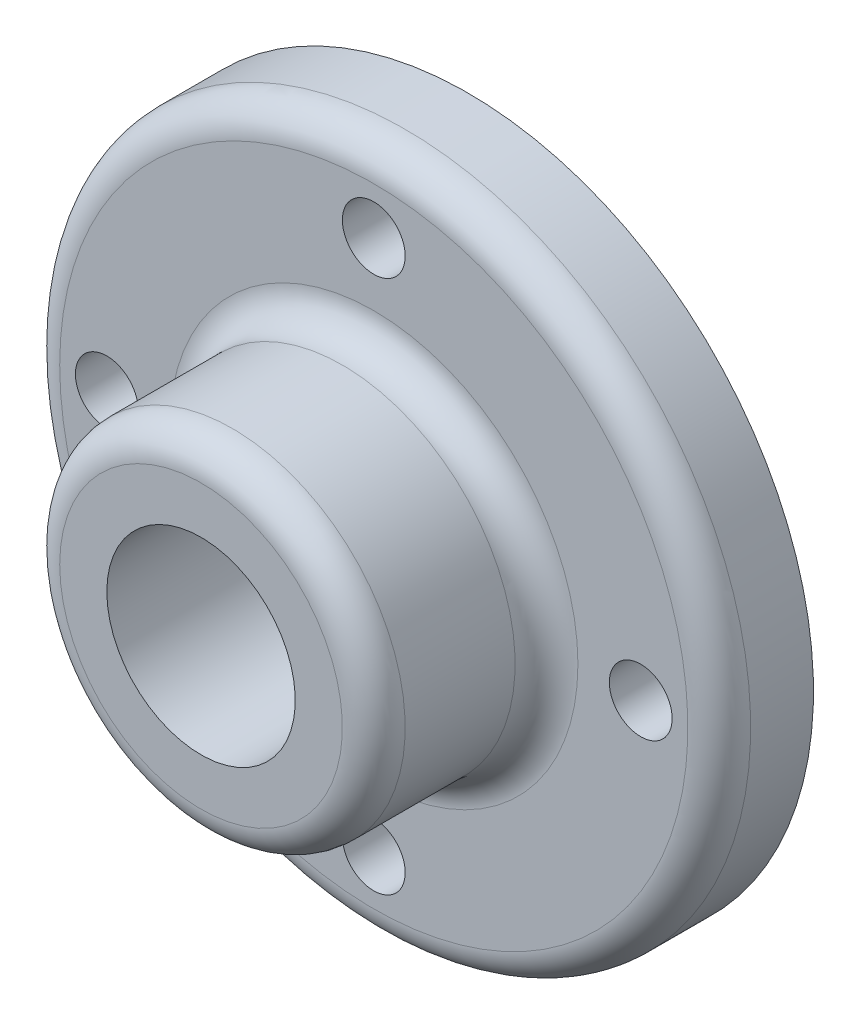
ISO-10303-21;
HEADER;
FILE_DESCRIPTION(('STEP AP214'),'2;1');
FILE_NAME('part.step','',(''),(''),'','','');
FILE_SCHEMA(('AUTOMOTIVE_DESIGN { 1 0 10303 214 1 1 1 1 }'));
ENDSEC;
DATA;
#1=APPLICATION_CONTEXT('core data for automotive mechanical design processes');
#2=APPLICATION_PROTOCOL_DEFINITION('international standard','automotive_design',2000,#1);
#3=PRODUCT_CONTEXT('',#1,'mechanical');
#4=PRODUCT('Part','Part','',(#3));
#5=PRODUCT_RELATED_PRODUCT_CATEGORY('part','',(#4));
#6=PRODUCT_DEFINITION_FORMATION('','',#4);
#7=PRODUCT_DEFINITION_CONTEXT('part definition',#1,'design');
#8=PRODUCT_DEFINITION('design','',#6,#7);
#9=PRODUCT_DEFINITION_SHAPE('','',#8);
#10=(LENGTH_UNIT() NAMED_UNIT(*) SI_UNIT(.MILLI.,.METRE.));
#11=(NAMED_UNIT(*) PLANE_ANGLE_UNIT() SI_UNIT($,.RADIAN.));
#12=(NAMED_UNIT(*) SI_UNIT($,.STERADIAN.) SOLID_ANGLE_UNIT());
#13=UNCERTAINTY_MEASURE_WITH_UNIT(LENGTH_MEASURE(1.E-05),#10,'distance_accuracy_value','');
#14=(GEOMETRIC_REPRESENTATION_CONTEXT(3) GLOBAL_UNCERTAINTY_ASSIGNED_CONTEXT((#13)) GLOBAL_UNIT_ASSIGNED_CONTEXT((#10,
#11,#12)) REPRESENTATION_CONTEXT('',''));
#15=CARTESIAN_POINT('',(0.,0.,0.));
#16=DIRECTION('',(0.,0.,1.));
#17=DIRECTION('',(1.,0.,0.));
#18=AXIS2_PLACEMENT_3D('',#15,#16,#17);
#19=CARTESIAN_POINT('',(69.85,0.,0.));
#20=DIRECTION('',(0.,0.,1.));
#21=DIRECTION('',(1.,0.,0.));
#22=AXIS2_PLACEMENT_3D('',#19,#20,#21);
#23=PLANE('',#22);
#24=CARTESIAN_POINT('',(5.65358443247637E-13,-53.975,0.));
#25=DIRECTION('',(0.,0.,-1.));
#26=DIRECTION('',(0.,1.,0.));
#27=AXIS2_PLACEMENT_3D('',#24,#25,#26);
#28=CIRCLE('',#27,6.35);
#29=CARTESIAN_POINT('',(4.98845685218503E-13,-47.625,0.));
#30=VERTEX_POINT('',#29);
#31=EDGE_CURVE('E63',#30,#30,#28,.T.);
#32=ORIENTED_EDGE('',*,*,#31,.F.);
#33=EDGE_LOOP('',(#32));
#34=FACE_BOUND('',#33,.T.);
#35=CARTESIAN_POINT('',(-53.975,-3.76905628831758E-13,0.));
#36=DIRECTION('',(0.,0.,-1.));
#37=DIRECTION('',(1.,0.,0.));
#38=AXIS2_PLACEMENT_3D('',#35,#36,#37);
#39=CIRCLE('',#38,6.35);
#40=CARTESIAN_POINT('',(-47.625,-3.32563790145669E-13,0.));
#41=VERTEX_POINT('',#40);
#42=EDGE_CURVE('E53',#41,#41,#39,.T.);
#43=ORIENTED_EDGE('',*,*,#42,.F.);
#44=EDGE_LOOP('',(#43));
#45=FACE_BOUND('',#44,.T.);
#46=CARTESIAN_POINT('',(-1.88452814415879E-13,53.975,0.));
#47=DIRECTION('',(0.,0.,-1.));
#48=DIRECTION('',(0.,-1.,0.));
#49=AXIS2_PLACEMENT_3D('',#46,#47,#48);
#50=CIRCLE('',#49,6.35);
#51=CARTESIAN_POINT('',(-1.66281895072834E-13,47.625,0.));
#52=VERTEX_POINT('',#51);
#53=EDGE_CURVE('E50',#52,#52,#50,.T.);
#54=ORIENTED_EDGE('',*,*,#53,.F.);
#55=EDGE_LOOP('',(#54));
#56=FACE_BOUND('',#55,.T.);
#57=CARTESIAN_POINT('',(53.975,0.,0.));
#58=DIRECTION('',(0.,0.,-1.));
#59=DIRECTION('',(-1.,0.,0.));
#60=AXIS2_PLACEMENT_3D('',#57,#58,#59);
#61=CIRCLE('',#60,6.35);
#62=CARTESIAN_POINT('',(47.625,0.,0.));
#63=VERTEX_POINT('',#62);
#64=EDGE_CURVE('E47',#63,#63,#61,.T.);
#65=ORIENTED_EDGE('',*,*,#64,.F.);
#66=EDGE_LOOP('',(#65));
#67=FACE_BOUND('',#66,.T.);
#68=CARTESIAN_POINT('',(0.,0.,0.));
#69=DIRECTION('',(0.,0.,-1.));
#70=DIRECTION('',(-1.,0.,0.));
#71=AXIS2_PLACEMENT_3D('',#68,#69,#70);
#72=CIRCLE('',#71,19.05);
#73=CARTESIAN_POINT('',(-19.05,0.,0.));
#74=VERTEX_POINT('',#73);
#75=EDGE_CURVE('E73',#74,#74,#72,.T.);
#76=ORIENTED_EDGE('',*,*,#75,.F.);
#77=EDGE_LOOP('',(#76));
#78=FACE_BOUND('',#77,.T.);
#79=CARTESIAN_POINT('',(0.,0.,0.));
#80=DIRECTION('',(0.,0.,-1.));
#81=DIRECTION('',(-1.,0.,0.));
#82=AXIS2_PLACEMENT_3D('',#79,#80,#81);
#83=CIRCLE('',#82,69.85);
#84=CARTESIAN_POINT('',(-69.85,0.,0.));
#85=VERTEX_POINT('',#84);
#86=EDGE_CURVE('E46',#85,#85,#83,.T.);
#87=ORIENTED_EDGE('',*,*,#86,.T.);
#88=EDGE_LOOP('',(#87));
#89=FACE_BOUND('',#88,.T.);
#90=ADVANCED_FACE('F27',(#34,#45,#56,#67,#78,#89),#23,.F.);
#91=CARTESIAN_POINT('',(0.,0.,0.));
#92=DIRECTION('',(0.,0.,-1.));
#93=DIRECTION('',(-1.,0.,0.));
#94=AXIS2_PLACEMENT_3D('',#91,#92,#93);
#95=CYLINDRICAL_SURFACE('',#94,19.05);
#96=CARTESIAN_POINT('',(0.,0.,53.975));
#97=DIRECTION('',(0.,0.,-1.));
#98=DIRECTION('',(-1.,0.,0.));
#99=AXIS2_PLACEMENT_3D('',#96,#97,#98);
#100=CIRCLE('',#99,19.05);
#101=CARTESIAN_POINT('',(-19.05,0.,53.975));
#102=VERTEX_POINT('',#101);
#103=EDGE_CURVE('E70',#102,#102,#100,.T.);
#104=ORIENTED_EDGE('',*,*,#103,.F.);
#105=EDGE_LOOP('',(#104));
#106=FACE_BOUND('',#105,.T.);
#107=ORIENTED_EDGE('',*,*,#75,.T.);
#108=EDGE_LOOP('',(#107));
#109=FACE_BOUND('',#108,.T.);
#110=ADVANCED_FACE('F106',(#106,#109),#95,.F.);
#111=CARTESIAN_POINT('',(19.05,0.,53.975));
#112=DIRECTION('',(0.,0.,-1.));
#113=DIRECTION('',(-1.,0.,0.));
#114=AXIS2_PLACEMENT_3D('',#111,#112,#113);
#115=PLANE('',#114);
#116=CARTESIAN_POINT('',(0.,0.,53.975));
#117=DIRECTION('',(0.,0.,-1.));
#118=DIRECTION('',(-1.,0.,0.));
#119=AXIS2_PLACEMENT_3D('',#116,#117,#118);
#120=CIRCLE('',#119,28.575);
#121=CARTESIAN_POINT('',(-28.575,0.,53.975));
#122=VERTEX_POINT('',#121);
#123=EDGE_CURVE('E82',#122,#122,#120,.F.);
#124=ORIENTED_EDGE('',*,*,#123,.T.);
#125=EDGE_LOOP('',(#124));
#126=FACE_BOUND('',#125,.T.);
#127=ORIENTED_EDGE('',*,*,#103,.T.);
#128=EDGE_LOOP('',(#127));
#129=FACE_BOUND('',#128,.T.);
#130=ADVANCED_FACE('F112',(#126,#129),#115,.F.);
#131=CARTESIAN_POINT('',(0.,0.,0.));
#132=DIRECTION('',(0.,0.,-1.));
#133=DIRECTION('',(-1.,0.,0.));
#134=AXIS2_PLACEMENT_3D('',#131,#132,#133);
#135=CYLINDRICAL_SURFACE('',#134,34.925);
#136=CARTESIAN_POINT('',(0.,0.,47.625));
#137=DIRECTION('',(0.,0.,-1.));
#138=DIRECTION('',(-1.,0.,0.));
#139=AXIS2_PLACEMENT_3D('',#136,#137,#138);
#140=CIRCLE('',#139,34.925);
#141=CARTESIAN_POINT('',(-34.925,0.,47.625));
#142=VERTEX_POINT('',#141);
#143=EDGE_CURVE('E79',#142,#142,#140,.T.);
#144=ORIENTED_EDGE('',*,*,#143,.T.);
#145=EDGE_LOOP('',(#144));
#146=FACE_BOUND('',#145,.T.);
#147=CARTESIAN_POINT('',(0.,0.,25.4));
#148=DIRECTION('',(0.,0.,-1.));
#149=DIRECTION('',(-1.,0.,0.));
#150=AXIS2_PLACEMENT_3D('',#147,#148,#149);
#151=CIRCLE('',#150,34.925);
#152=CARTESIAN_POINT('',(-34.925,0.,25.4));
#153=VERTEX_POINT('',#152);
#154=EDGE_CURVE('E76',#153,#153,#151,.F.);
#155=ORIENTED_EDGE('',*,*,#154,.T.);
#156=EDGE_LOOP('',(#155));
#157=FACE_BOUND('',#156,.T.);
#158=ADVANCED_FACE('F135',(#146,#157),#135,.T.);
#159=CARTESIAN_POINT('',(34.925,0.,19.05));
#160=DIRECTION('',(0.,0.,-1.));
#161=DIRECTION('',(-1.,0.,0.));
#162=AXIS2_PLACEMENT_3D('',#159,#160,#161);
#163=PLANE('',#162);
#164=CARTESIAN_POINT('',(5.65358443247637E-13,-53.975,19.05));
#165=DIRECTION('',(0.,0.,-1.));
#166=DIRECTION('',(-1.,0.,0.));
#167=AXIS2_PLACEMENT_3D('',#164,#165,#166);
#168=CIRCLE('',#167,6.35);
#169=CARTESIAN_POINT('',(-6.34999999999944,-53.975,19.05));
#170=VERTEX_POINT('',#169);
#171=EDGE_CURVE('E30',#170,#170,#168,.T.);
#172=ORIENTED_EDGE('',*,*,#171,.T.);
#173=EDGE_LOOP('',(#172));
#174=FACE_BOUND('',#173,.T.);
#175=CARTESIAN_POINT('',(-53.975,-3.76905628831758E-13,19.05));
#176=DIRECTION('',(0.,0.,-1.));
#177=DIRECTION('',(-1.,0.,0.));
#178=AXIS2_PLACEMENT_3D('',#175,#176,#177);
#179=CIRCLE('',#178,6.35);
#180=CARTESIAN_POINT('',(-60.325,-3.76905628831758E-13,19.05));
#181=VERTEX_POINT('',#180);
#182=EDGE_CURVE('E51',#181,#181,#179,.T.);
#183=ORIENTED_EDGE('',*,*,#182,.T.);
#184=EDGE_LOOP('',(#183));
#185=FACE_BOUND('',#184,.T.);
#186=CARTESIAN_POINT('',(-1.88452814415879E-13,53.975,19.05));
#187=DIRECTION('',(0.,0.,-1.));
#188=DIRECTION('',(-1.,0.,0.));
#189=AXIS2_PLACEMENT_3D('',#186,#187,#188);
#190=CIRCLE('',#189,6.35);
#191=CARTESIAN_POINT('',(-6.35000000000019,53.975,19.05));
#192=VERTEX_POINT('',#191);
#193=EDGE_CURVE('E48',#192,#192,#190,.T.);
#194=ORIENTED_EDGE('',*,*,#193,.T.);
#195=EDGE_LOOP('',(#194));
#196=FACE_BOUND('',#195,.T.);
#197=CARTESIAN_POINT('',(53.975,0.,19.05));
#198=DIRECTION('',(0.,0.,-1.));
#199=DIRECTION('',(-1.,0.,0.));
#200=AXIS2_PLACEMENT_3D('',#197,#198,#199);
#201=CIRCLE('',#200,6.35);
#202=CARTESIAN_POINT('',(47.625,0.,19.05));
#203=VERTEX_POINT('',#202);
#204=EDGE_CURVE('E43',#203,#203,#201,.T.);
#205=ORIENTED_EDGE('',*,*,#204,.T.);
#206=EDGE_LOOP('',(#205));
#207=FACE_BOUND('',#206,.T.);
#208=CARTESIAN_POINT('',(0.,0.,19.05));
#209=DIRECTION('',(0.,0.,-1.));
#210=DIRECTION('',(-1.,0.,0.));
#211=AXIS2_PLACEMENT_3D('',#208,#209,#210);
#212=CIRCLE('',#211,41.275);
#213=CARTESIAN_POINT('',(-41.275,0.,19.05));
#214=VERTEX_POINT('',#213);
#215=EDGE_CURVE('E34',#214,#214,#212,.T.);
#216=ORIENTED_EDGE('',*,*,#215,.T.);
#217=EDGE_LOOP('',(#216));
#218=FACE_BOUND('',#217,.T.);
#219=CARTESIAN_POINT('',(0.,0.,19.05));
#220=DIRECTION('',(0.,0.,-1.));
#221=DIRECTION('',(-1.,0.,0.));
#222=AXIS2_PLACEMENT_3D('',#219,#220,#221);
#223=CIRCLE('',#222,63.5);
#224=CARTESIAN_POINT('',(-63.5,0.,19.05));
#225=VERTEX_POINT('',#224);
#226=EDGE_CURVE('E39',#225,#225,#223,.F.);
#227=ORIENTED_EDGE('',*,*,#226,.T.);
#228=EDGE_LOOP('',(#227));
#229=FACE_BOUND('',#228,.T.);
#230=ADVANCED_FACE('F87',(#174,#185,#196,#207,#218,#229),#163,.F.);
#231=CARTESIAN_POINT('',(0.,0.,0.));
#232=DIRECTION('',(0.,0.,-1.));
#233=DIRECTION('',(-1.,0.,0.));
#234=AXIS2_PLACEMENT_3D('',#231,#232,#233);
#235=CYLINDRICAL_SURFACE('',#234,69.85);
#236=CARTESIAN_POINT('',(0.,0.,12.7));
#237=DIRECTION('',(0.,0.,-1.));
#238=DIRECTION('',(-1.,0.,0.));
#239=AXIS2_PLACEMENT_3D('',#236,#237,#238);
#240=CIRCLE('',#239,69.85);
#241=CARTESIAN_POINT('',(-69.85,0.,12.7));
#242=VERTEX_POINT('',#241);
#243=EDGE_CURVE('E10',#242,#242,#240,.T.);
#244=ORIENTED_EDGE('',*,*,#243,.T.);
#245=EDGE_LOOP('',(#244));
#246=FACE_BOUND('',#245,.T.);
#247=ORIENTED_EDGE('',*,*,#86,.F.);
#248=EDGE_LOOP('',(#247));
#249=FACE_BOUND('',#248,.T.);
#250=ADVANCED_FACE('F126',(#246,#249),#235,.T.);
#251=CARTESIAN_POINT('',(0.,0.,47.625));
#252=DIRECTION('',(0.,0.,-1.));
#253=DIRECTION('',(-1.,0.,0.));
#254=AXIS2_PLACEMENT_3D('',#251,#252,#253);
#255=TOROIDAL_SURFACE('',#254,28.575,6.35);
#256=ORIENTED_EDGE('',*,*,#123,.F.);
#257=EDGE_LOOP('',(#256));
#258=FACE_BOUND('',#257,.T.);
#259=ORIENTED_EDGE('',*,*,#143,.F.);
#260=EDGE_LOOP('',(#259));
#261=FACE_BOUND('',#260,.T.);
#262=ADVANCED_FACE('F102',(#258,#261),#255,.T.);
#263=CARTESIAN_POINT('',(0.,0.,25.4));
#264=DIRECTION('',(0.,0.,-1.));
#265=DIRECTION('',(-1.,0.,0.));
#266=AXIS2_PLACEMENT_3D('',#263,#264,#265);
#267=TOROIDAL_SURFACE('',#266,41.275,6.35);
#268=ORIENTED_EDGE('',*,*,#154,.F.);
#269=EDGE_LOOP('',(#268));
#270=FACE_BOUND('',#269,.T.);
#271=ORIENTED_EDGE('',*,*,#215,.F.);
#272=EDGE_LOOP('',(#271));
#273=FACE_BOUND('',#272,.T.);
#274=ADVANCED_FACE('F93',(#270,#273),#267,.F.);
#275=CARTESIAN_POINT('',(0.,0.,12.7));
#276=DIRECTION('',(0.,0.,-1.));
#277=DIRECTION('',(-1.,0.,0.));
#278=AXIS2_PLACEMENT_3D('',#275,#276,#277);
#279=TOROIDAL_SURFACE('',#278,63.5,6.35);
#280=ORIENTED_EDGE('',*,*,#226,.F.);
#281=EDGE_LOOP('',(#280));
#282=FACE_BOUND('',#281,.T.);
#283=ORIENTED_EDGE('',*,*,#243,.F.);
#284=EDGE_LOOP('',(#283));
#285=FACE_BOUND('',#284,.T.);
#286=ADVANCED_FACE('F89',(#282,#285),#279,.T.);
#287=CARTESIAN_POINT('',(53.975,0.,53.975));
#288=DIRECTION('',(0.,0.,-1.));
#289=DIRECTION('',(-1.,0.,0.));
#290=AXIS2_PLACEMENT_3D('',#287,#288,#289);
#291=CYLINDRICAL_SURFACE('',#290,6.35);
#292=ORIENTED_EDGE('',*,*,#64,.T.);
#293=EDGE_LOOP('',(#292));
#294=FACE_BOUND('',#293,.T.);
#295=ORIENTED_EDGE('',*,*,#204,.F.);
#296=EDGE_LOOP('',(#295));
#297=FACE_BOUND('',#296,.T.);
#298=ADVANCED_FACE('F92',(#294,#297),#291,.F.);
#299=CARTESIAN_POINT('',(-1.88452814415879E-13,53.975,53.975));
#300=DIRECTION('',(0.,0.,-1.));
#301=DIRECTION('',(-1.,0.,0.));
#302=AXIS2_PLACEMENT_3D('',#299,#300,#301);
#303=CYLINDRICAL_SURFACE('',#302,6.35);
#304=ORIENTED_EDGE('',*,*,#53,.T.);
#305=EDGE_LOOP('',(#304));
#306=FACE_BOUND('',#305,.T.);
#307=ORIENTED_EDGE('',*,*,#193,.F.);
#308=EDGE_LOOP('',(#307));
#309=FACE_BOUND('',#308,.T.);
#310=ADVANCED_FACE('F99',(#306,#309),#303,.F.);
#311=CARTESIAN_POINT('',(-53.975,-3.76905628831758E-13,53.975));
#312=DIRECTION('',(0.,0.,-1.));
#313=DIRECTION('',(-1.,0.,0.));
#314=AXIS2_PLACEMENT_3D('',#311,#312,#313);
#315=CYLINDRICAL_SURFACE('',#314,6.35);
#316=ORIENTED_EDGE('',*,*,#42,.T.);
#317=EDGE_LOOP('',(#316));
#318=FACE_BOUND('',#317,.T.);
#319=ORIENTED_EDGE('',*,*,#182,.F.);
#320=EDGE_LOOP('',(#319));
#321=FACE_BOUND('',#320,.T.);
#322=ADVANCED_FACE('F189',(#318,#321),#315,.F.);
#323=CARTESIAN_POINT('',(5.65358443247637E-13,-53.975,53.975));
#324=DIRECTION('',(0.,0.,-1.));
#325=DIRECTION('',(-1.,0.,0.));
#326=AXIS2_PLACEMENT_3D('',#323,#324,#325);
#327=CYLINDRICAL_SURFACE('',#326,6.35);
#328=ORIENTED_EDGE('',*,*,#31,.T.);
#329=EDGE_LOOP('',(#328));
#330=FACE_BOUND('',#329,.T.);
#331=ORIENTED_EDGE('',*,*,#171,.F.);
#332=EDGE_LOOP('',(#331));
#333=FACE_BOUND('',#332,.T.);
#334=ADVANCED_FACE('F197',(#330,#333),#327,.F.);
#335=CLOSED_SHELL('',(#90,#110,#130,#158,#230,#250,#262,#274,#286,#298,#310,#322,#334));
#336=MANIFOLD_SOLID_BREP('B2',#335);
#337=ADVANCED_BREP_SHAPE_REPRESENTATION('',(#18,#336),#14);
#338=SHAPE_DEFINITION_REPRESENTATION(#9,#337);
ENDSEC;
END-ISO-10303-21;
